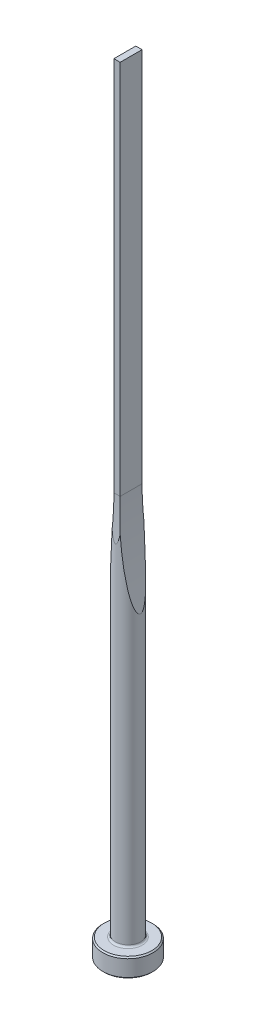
from build123d import *

# Parameters (mm, degrees)
CUT_EXTRUDE1_DEPTH = 5
CUT_EXTRUDE2_DEPTH = 5


with BuildPart() as part:
    # Sketch1 → Revolve1 (revolve)
    with BuildSketch(Plane.XY, mode=Mode.PRIVATE) as revolve1_sk:
        with BuildLine():
            Line((0, 0), (3.8, 0))
            Line((3.8, 0), (4, 0.2))
            Line((4, 0.2), (4, 2.8))
            Line((4, 2.8), (3.8, 3))
            Line((3.8, 3), (2.3, 3))
            ThreePointArc((2.3, 3), (2.087867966, 3.087867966), (2, 3.3))
            Line((2, 3.3), (2, 125))
            Line((2, 125), (0, 125))
            Line((0, 125), (0, 0))
        make_face()
    revolve(revolve1_sk.sketch.rotate(Axis((0, 125, 0), (0, -1, 0)), 180), axis=Axis((0, 125, 0), (0, -1, 0)))

    # Sketch2 → Cut-Extrude1 (cut, symmetric)
    with BuildSketch(Plane.XY):
        with BuildLine():
            Line((0.5, 125), (0.5, 65))
            ThreePointArc((0.5, 65), (0.875784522, 56.784161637), (2, 48.636931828))
            Line((2, 48.636931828), (2, 125))
            Line((2, 125), (0.5, 125))
        make_face()
        with BuildLine():
            Line((-0.5, 125), (-0.5, 65))
            ThreePointArc((-0.5, 65), (-0.875784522, 56.784161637), (-2, 48.636931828))
            Line((-2, 48.636931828), (-2, 125))
            Line((-2, 125), (-0.5, 125))
        make_face()
    extrude(amount=CUT_EXTRUDE1_DEPTH, both=True, mode=Mode.SUBTRACT)

    # Sketch3 → Cut-Extrude2 (cut, symmetric)
    with BuildSketch(Plane(origin=(0, 0, 0), x_dir=(0, 0, -1), z_dir=(1, 0, 0))):
        with BuildLine():
            Line((1.75, 125), (1.75, 65))
            ThreePointArc((1.75, 65), (1.812521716, 61.645898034), (2, 58.296456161))
            Line((2, 58.296456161), (2, 125))
            Line((2, 125), (1.75, 125))
        make_face()
        with BuildLine():
            Line((-1.75, 125), (-1.75, 65))
            ThreePointArc((-1.75, 65), (-1.812521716, 61.645898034), (-2, 58.296456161))
            Line((-2, 58.296456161), (-2, 125))
            Line((-2, 125), (-1.75, 125))
        make_face()
    extrude(amount=CUT_EXTRUDE2_DEPTH, both=True, mode=Mode.SUBTRACT)


solid = part.part
